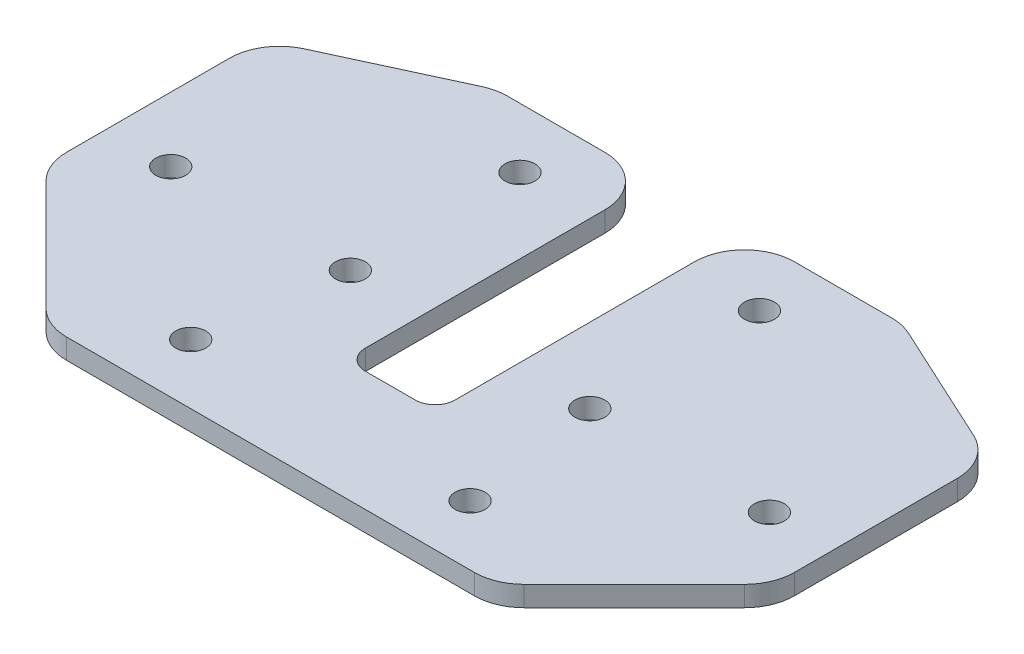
ISO-10303-21;
HEADER;
FILE_DESCRIPTION(('STEP AP214'),'2;1');
FILE_NAME('part.step','',(''),(''),'','','');
FILE_SCHEMA(('AUTOMOTIVE_DESIGN { 1 0 10303 214 1 1 1 1 }'));
ENDSEC;
DATA;
#1=APPLICATION_CONTEXT('core data for automotive mechanical design processes');
#2=APPLICATION_PROTOCOL_DEFINITION('international standard','automotive_design',2000,#1);
#3=PRODUCT_CONTEXT('',#1,'mechanical');
#4=PRODUCT('Part','Part','',(#3));
#5=PRODUCT_RELATED_PRODUCT_CATEGORY('part','',(#4));
#6=PRODUCT_DEFINITION_FORMATION('','',#4);
#7=PRODUCT_DEFINITION_CONTEXT('part definition',#1,'design');
#8=PRODUCT_DEFINITION('design','',#6,#7);
#9=PRODUCT_DEFINITION_SHAPE('','',#8);
#10=(LENGTH_UNIT() NAMED_UNIT(*) SI_UNIT(.MILLI.,.METRE.));
#11=(NAMED_UNIT(*) PLANE_ANGLE_UNIT() SI_UNIT($,.RADIAN.));
#12=(NAMED_UNIT(*) SI_UNIT($,.STERADIAN.) SOLID_ANGLE_UNIT());
#13=UNCERTAINTY_MEASURE_WITH_UNIT(LENGTH_MEASURE(1.E-05),#10,'distance_accuracy_value','');
#14=(GEOMETRIC_REPRESENTATION_CONTEXT(3) GLOBAL_UNCERTAINTY_ASSIGNED_CONTEXT((#13)) GLOBAL_UNIT_ASSIGNED_CONTEXT((#10,
#11,#12)) REPRESENTATION_CONTEXT('',''));
#15=CARTESIAN_POINT('',(0.,0.,0.));
#16=DIRECTION('',(0.,0.,1.));
#17=DIRECTION('',(1.,0.,0.));
#18=AXIS2_PLACEMENT_3D('',#15,#16,#17);
#19=CARTESIAN_POINT('',(0.,2.032,0.));
#20=DIRECTION('',(0.,1.,0.));
#21=DIRECTION('',(0.,0.,1.));
#22=AXIS2_PLACEMENT_3D('',#19,#20,#21);
#23=PLANE('',#22);
#24=CARTESIAN_POINT('',(22.6390243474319,2.032,11.8595094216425));
#25=DIRECTION('',(0.,1.,0.));
#26=DIRECTION('',(0.,0.,1.));
#27=AXIS2_PLACEMENT_3D('',#24,#25,#26);
#28=CIRCLE('',#27,1.5);
#29=CARTESIAN_POINT('',(22.6390243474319,2.032,13.3595094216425));
#30=VERTEX_POINT('',#29);
#31=EDGE_CURVE('E441',#30,#30,#28,.T.);
#32=ORIENTED_EDGE('',*,*,#31,.F.);
#33=EDGE_LOOP('',(#32));
#34=FACE_BOUND('',#33,.T.);
#35=CARTESIAN_POINT('',(24.6390243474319,2.032,-19.1404905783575));
#36=DIRECTION('',(0.,1.,0.));
#37=DIRECTION('',(0.,0.,1.));
#38=AXIS2_PLACEMENT_3D('',#35,#36,#37);
#39=CIRCLE('',#38,1.5);
#40=CARTESIAN_POINT('',(24.6390243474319,2.032,-17.6404905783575));
#41=VERTEX_POINT('',#40);
#42=EDGE_CURVE('E343',#41,#41,#39,.T.);
#43=ORIENTED_EDGE('',*,*,#42,.F.);
#44=EDGE_LOOP('',(#43));
#45=FACE_BOUND('',#44,.T.);
#46=DIRECTION('',(1.,0.,0.));
#47=VECTOR('',#46,1.);
#48=CARTESIAN_POINT('',(41.1390243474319,2.032,-25.1404905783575));
#49=LINE('',#48,#47);
#50=CARTESIAN_POINT('',(46.1390243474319,2.032,-25.1404905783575));
#51=VERTEX_POINT('',#50);
#52=CARTESIAN_POINT('',(55.9142916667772,2.032,-25.1404905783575));
#53=VERTEX_POINT('',#52);
#54=EDGE_CURVE('E420',#51,#53,#49,.T.);
#55=ORIENTED_EDGE('',*,*,#54,.F.);
#56=CARTESIAN_POINT('',(46.1390243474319,2.032,-20.1404905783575));
#57=DIRECTION('',(0.,1.,0.));
#58=DIRECTION('',(0.,0.,1.));
#59=AXIS2_PLACEMENT_3D('',#56,#57,#58);
#60=CIRCLE('',#59,5.);
#61=CARTESIAN_POINT('',(41.1390243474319,2.032,-20.1404905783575));
#62=VERTEX_POINT('',#61);
#63=EDGE_CURVE('E260',#51,#62,#60,.T.);
#64=ORIENTED_EDGE('',*,*,#63,.T.);
#65=DIRECTION('',(0.,0.,-1.));
#66=VECTOR('',#65,1.);
#67=CARTESIAN_POINT('',(41.1390243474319,2.032,5.85950942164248));
#68=LINE('',#67,#66);
#69=CARTESIAN_POINT('',(41.1390243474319,2.032,3.85950942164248));
#70=VERTEX_POINT('',#69);
#71=EDGE_CURVE('E210',#70,#62,#68,.T.);
#72=ORIENTED_EDGE('',*,*,#71,.F.);
#73=CARTESIAN_POINT('',(39.1390243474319,2.032,3.85950942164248));
#74=DIRECTION('',(0.,1.,0.));
#75=DIRECTION('',(0.,0.,1.));
#76=AXIS2_PLACEMENT_3D('',#73,#74,#75);
#77=CIRCLE('',#76,2.);
#78=CARTESIAN_POINT('',(39.1390243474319,2.032,5.85950942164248));
#79=VERTEX_POINT('',#78);
#80=EDGE_CURVE('E11',#70,#79,#77,.F.);
#81=ORIENTED_EDGE('',*,*,#80,.T.);
#82=DIRECTION('',(-1.,0.,0.));
#83=VECTOR('',#82,1.);
#84=CARTESIAN_POINT('',(36.6390243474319,2.032,5.85950942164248));
#85=LINE('',#84,#83);
#86=CARTESIAN_POINT('',(34.1390243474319,2.032,5.85950942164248));
#87=VERTEX_POINT('',#86);
#88=EDGE_CURVE('E325',#79,#87,#85,.T.);
#89=ORIENTED_EDGE('',*,*,#88,.T.);
#90=CARTESIAN_POINT('',(34.1390243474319,2.032,3.85950942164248));
#91=DIRECTION('',(0.,1.,0.));
#92=DIRECTION('',(0.,0.,1.));
#93=AXIS2_PLACEMENT_3D('',#90,#91,#92);
#94=CIRCLE('',#93,2.);
#95=CARTESIAN_POINT('',(32.1390243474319,2.032,3.85950942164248));
#96=VERTEX_POINT('',#95);
#97=EDGE_CURVE('E316',#87,#96,#94,.F.);
#98=ORIENTED_EDGE('',*,*,#97,.T.);
#99=DIRECTION('',(0.,0.,-1.));
#100=VECTOR('',#99,1.);
#101=CARTESIAN_POINT('',(32.1390243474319,2.032,5.85950942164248));
#102=LINE('',#101,#100);
#103=CARTESIAN_POINT('',(32.1390243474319,2.032,-20.1404905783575));
#104=VERTEX_POINT('',#103);
#105=EDGE_CURVE('E323',#96,#104,#102,.T.);
#106=ORIENTED_EDGE('',*,*,#105,.T.);
#107=CARTESIAN_POINT('',(27.1390243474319,2.032,-20.1404905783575));
#108=DIRECTION('',(0.,1.,0.));
#109=DIRECTION('',(0.,0.,1.));
#110=AXIS2_PLACEMENT_3D('',#107,#108,#109);
#111=CIRCLE('',#110,5.);
#112=CARTESIAN_POINT('',(27.1390243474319,2.032,-25.1404905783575));
#113=VERTEX_POINT('',#112);
#114=EDGE_CURVE('E242',#104,#113,#111,.T.);
#115=ORIENTED_EDGE('',*,*,#114,.T.);
#116=DIRECTION('',(-1.,0.,0.));
#117=VECTOR('',#116,1.);
#118=CARTESIAN_POINT('',(32.1390243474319,2.032,-25.1404905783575));
#119=LINE('',#118,#117);
#120=CARTESIAN_POINT('',(17.3637570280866,2.032,-25.1404905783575));
#121=VERTEX_POINT('',#120);
#122=EDGE_CURVE('E334',#113,#121,#119,.T.);
#123=ORIENTED_EDGE('',*,*,#122,.T.);
#124=CARTESIAN_POINT('',(17.3637570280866,2.032,-20.1404905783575));
#125=DIRECTION('',(0.,1.,0.));
#126=DIRECTION('',(0.,0.,1.));
#127=AXIS2_PLACEMENT_3D('',#124,#125,#126);
#128=CIRCLE('',#127,5.);
#129=CARTESIAN_POINT('',(15.2657842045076,2.032,-24.6790487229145));
#130=VERTEX_POINT('',#129);
#131=EDGE_CURVE('E244',#121,#130,#128,.T.);
#132=ORIENTED_EDGE('',*,*,#131,.T.);
#133=DIRECTION('',(-0.907711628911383,0.,0.419594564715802));
#134=VECTOR('',#133,1.);
#135=CARTESIAN_POINT('',(16.2640243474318,2.032,-25.1404905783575));
#136=LINE('',#135,#134);
#137=CARTESIAN_POINT('',(3.07105152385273,2.032,-19.0419681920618));
#138=VERTEX_POINT('',#137);
#139=EDGE_CURVE('E378',#130,#138,#136,.T.);
#140=ORIENTED_EDGE('',*,*,#139,.T.);
#141=CARTESIAN_POINT('',(5.16902434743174,2.032,-14.5034100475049));
#142=DIRECTION('',(0.,1.,0.));
#143=DIRECTION('',(0.,0.,1.));
#144=AXIS2_PLACEMENT_3D('',#141,#142,#143);
#145=CIRCLE('',#144,5.);
#146=CARTESIAN_POINT('',(0.169024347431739,2.032,-14.5034100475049));
#147=VERTEX_POINT('',#146);
#148=EDGE_CURVE('E246',#138,#147,#145,.T.);
#149=ORIENTED_EDGE('',*,*,#148,.T.);
#150=DIRECTION('',(0.,0.,1.));
#151=VECTOR('',#150,1.);
#152=CARTESIAN_POINT('',(0.169024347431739,2.032,-10.0804905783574));
#153=LINE('',#152,#151);
#154=CARTESIAN_POINT('',(0.169024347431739,2.032,1.81844160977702));
#155=VERTEX_POINT('',#154);
#156=EDGE_CURVE('E219',#147,#155,#153,.T.);
#157=ORIENTED_EDGE('',*,*,#156,.T.);
#158=CARTESIAN_POINT('',(5.16902434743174,2.032,1.81844160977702));
#159=DIRECTION('',(0.,1.,0.));
#160=DIRECTION('',(0.,0.,1.));
#161=AXIS2_PLACEMENT_3D('',#158,#159,#160);
#162=CIRCLE('',#161,5.);
#163=CARTESIAN_POINT('',(1.633490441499,2.032,5.35397551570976));
#164=VERTEX_POINT('',#163);
#165=EDGE_CURVE('E248',#155,#164,#162,.T.);
#166=ORIENTED_EDGE('',*,*,#165,.T.);
#167=DIRECTION('',(0.707106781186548,0.,0.707106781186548));
#168=VECTOR('',#167,1.);
#169=CARTESIAN_POINT('',(14.1390243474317,2.032,17.8595094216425));
#170=LINE('',#169,#168);
#171=CARTESIAN_POINT('',(12.6745582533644,2.032,16.3950433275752));
#172=VERTEX_POINT('',#171);
#173=EDGE_CURVE('E213',#164,#172,#170,.T.);
#174=ORIENTED_EDGE('',*,*,#173,.T.);
#175=CARTESIAN_POINT('',(16.2100921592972,2.032,12.8595094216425));
#176=DIRECTION('',(0.,1.,0.));
#177=DIRECTION('',(0.,0.,1.));
#178=AXIS2_PLACEMENT_3D('',#175,#176,#177);
#179=CIRCLE('',#178,5.);
#180=CARTESIAN_POINT('',(16.2100921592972,2.032,17.8595094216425));
#181=VERTEX_POINT('',#180);
#182=EDGE_CURVE('E250',#172,#181,#179,.T.);
#183=ORIENTED_EDGE('',*,*,#182,.T.);
#184=DIRECTION('',(1.,0.,0.));
#185=VECTOR('',#184,1.);
#186=CARTESIAN_POINT('',(32.1390243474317,2.032,17.8595094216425));
#187=LINE('',#186,#185);
#188=CARTESIAN_POINT('',(57.0679565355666,2.032,17.8595094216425));
#189=VERTEX_POINT('',#188);
#190=EDGE_CURVE('E365',#181,#189,#187,.T.);
#191=ORIENTED_EDGE('',*,*,#190,.T.);
#192=CARTESIAN_POINT('',(57.0679565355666,2.032,12.8595094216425));
#193=DIRECTION('',(0.,1.,0.));
#194=DIRECTION('',(0.,0.,1.));
#195=AXIS2_PLACEMENT_3D('',#192,#193,#194);
#196=CIRCLE('',#195,5.);
#197=CARTESIAN_POINT('',(60.6034904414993,2.032,16.3950433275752));
#198=VERTEX_POINT('',#197);
#199=EDGE_CURVE('E252',#189,#198,#196,.T.);
#200=ORIENTED_EDGE('',*,*,#199,.T.);
#201=DIRECTION('',(-0.707106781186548,0.,0.707106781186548));
#202=VECTOR('',#201,1.);
#203=CARTESIAN_POINT('',(59.1390243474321,2.032,17.8595094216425));
#204=LINE('',#203,#202);
#205=CARTESIAN_POINT('',(71.6445582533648,2.032,5.35397551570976));
#206=VERTEX_POINT('',#205);
#207=EDGE_CURVE('E196',#206,#198,#204,.T.);
#208=ORIENTED_EDGE('',*,*,#207,.F.);
#209=CARTESIAN_POINT('',(68.109024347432,2.032,1.81844160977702));
#210=DIRECTION('',(0.,1.,0.));
#211=DIRECTION('',(0.,0.,1.));
#212=AXIS2_PLACEMENT_3D('',#209,#210,#211);
#213=CIRCLE('',#212,5.);
#214=CARTESIAN_POINT('',(73.109024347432,2.032,1.81844160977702));
#215=VERTEX_POINT('',#214);
#216=EDGE_CURVE('E254',#206,#215,#213,.T.);
#217=ORIENTED_EDGE('',*,*,#216,.T.);
#218=DIRECTION('',(0.,0.,1.));
#219=VECTOR('',#218,1.);
#220=CARTESIAN_POINT('',(73.109024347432,2.032,-10.0804905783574));
#221=LINE('',#220,#219);
#222=CARTESIAN_POINT('',(73.109024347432,2.032,-14.5034100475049));
#223=VERTEX_POINT('',#222);
#224=EDGE_CURVE('E409',#223,#215,#221,.T.);
#225=ORIENTED_EDGE('',*,*,#224,.F.);
#226=CARTESIAN_POINT('',(68.109024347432,2.032,-14.5034100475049));
#227=DIRECTION('',(0.,1.,0.));
#228=DIRECTION('',(0.,0.,1.));
#229=AXIS2_PLACEMENT_3D('',#226,#227,#228);
#230=CIRCLE('',#229,5.);
#231=CARTESIAN_POINT('',(70.206997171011,2.032,-19.0419681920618));
#232=VERTEX_POINT('',#231);
#233=EDGE_CURVE('E256',#223,#232,#230,.T.);
#234=ORIENTED_EDGE('',*,*,#233,.T.);
#235=DIRECTION('',(0.907711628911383,0.,0.419594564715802));
#236=VECTOR('',#235,1.);
#237=CARTESIAN_POINT('',(57.014024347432,2.032,-25.1404905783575));
#238=LINE('',#237,#236);
#239=CARTESIAN_POINT('',(58.0122644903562,2.032,-24.6790487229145));
#240=VERTEX_POINT('',#239);
#241=EDGE_CURVE('E412',#240,#232,#238,.T.);
#242=ORIENTED_EDGE('',*,*,#241,.F.);
#243=CARTESIAN_POINT('',(55.9142916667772,2.032,-20.1404905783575));
#244=DIRECTION('',(0.,1.,0.));
#245=DIRECTION('',(0.,0.,1.));
#246=AXIS2_PLACEMENT_3D('',#243,#244,#245);
#247=CIRCLE('',#246,5.);
#248=EDGE_CURVE('E258',#240,#53,#247,.T.);
#249=ORIENTED_EDGE('',*,*,#248,.T.);
#250=EDGE_LOOP('',(#55,#64,#72,#81,#89,#98,#106,#115,#123,#132,#140,#149,#157,#166,#174,#183,
#191,#200,#208,#217,#225,#234,#242,#249));
#251=FACE_BOUND('',#250,.T.);
#252=CARTESIAN_POINT('',(24.6390243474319,2.032,-2.14049057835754));
#253=DIRECTION('',(0.,1.,0.));
#254=DIRECTION('',(0.,0.,1.));
#255=AXIS2_PLACEMENT_3D('',#252,#253,#254);
#256=CIRCLE('',#255,1.5);
#257=CARTESIAN_POINT('',(24.6390243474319,2.032,-0.640490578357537));
#258=VERTEX_POINT('',#257);
#259=EDGE_CURVE('E447',#258,#258,#256,.T.);
#260=ORIENTED_EDGE('',*,*,#259,.F.);
#261=EDGE_LOOP('',(#260));
#262=FACE_BOUND('',#261,.T.);
#263=CARTESIAN_POINT('',(6.63902434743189,2.032,-2.14049057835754));
#264=DIRECTION('',(0.,1.,0.));
#265=DIRECTION('',(0.,0.,1.));
#266=AXIS2_PLACEMENT_3D('',#263,#264,#265);
#267=CIRCLE('',#266,1.5);
#268=CARTESIAN_POINT('',(6.63902434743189,2.032,-0.640490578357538));
#269=VERTEX_POINT('',#268);
#270=EDGE_CURVE('E435',#269,#269,#267,.T.);
#271=ORIENTED_EDGE('',*,*,#270,.F.);
#272=EDGE_LOOP('',(#271));
#273=FACE_BOUND('',#272,.T.);
#274=CARTESIAN_POINT('',(66.6390243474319,2.032,-2.14049057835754));
#275=DIRECTION('',(0.,-1.,0.));
#276=DIRECTION('',(0.,0.,1.));
#277=AXIS2_PLACEMENT_3D('',#274,#275,#276);
#278=CIRCLE('',#277,1.5);
#279=CARTESIAN_POINT('',(66.6390243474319,2.032,-0.640490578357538));
#280=VERTEX_POINT('',#279);
#281=EDGE_CURVE('E599',#280,#280,#278,.T.);
#282=ORIENTED_EDGE('',*,*,#281,.T.);
#283=EDGE_LOOP('',(#282));
#284=FACE_BOUND('',#283,.T.);
#285=CARTESIAN_POINT('',(50.6390243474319,2.032,11.8595094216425));
#286=DIRECTION('',(0.,-1.,0.));
#287=DIRECTION('',(0.,0.,1.));
#288=AXIS2_PLACEMENT_3D('',#285,#286,#287);
#289=CIRCLE('',#288,1.5);
#290=CARTESIAN_POINT('',(50.6390243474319,2.032,13.3595094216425));
#291=VERTEX_POINT('',#290);
#292=EDGE_CURVE('E595',#291,#291,#289,.T.);
#293=ORIENTED_EDGE('',*,*,#292,.T.);
#294=EDGE_LOOP('',(#293));
#295=FACE_BOUND('',#294,.T.);
#296=CARTESIAN_POINT('',(48.6390243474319,2.032,-2.14049057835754));
#297=DIRECTION('',(0.,-1.,0.));
#298=DIRECTION('',(0.,0.,1.));
#299=AXIS2_PLACEMENT_3D('',#296,#297,#298);
#300=CIRCLE('',#299,1.5);
#301=CARTESIAN_POINT('',(48.6390243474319,2.032,-0.640490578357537));
#302=VERTEX_POINT('',#301);
#303=EDGE_CURVE('E589',#302,#302,#300,.T.);
#304=ORIENTED_EDGE('',*,*,#303,.T.);
#305=EDGE_LOOP('',(#304));
#306=FACE_BOUND('',#305,.T.);
#307=CARTESIAN_POINT('',(48.6390243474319,2.032,-19.1404905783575));
#308=DIRECTION('',(0.,-1.,0.));
#309=DIRECTION('',(0.,0.,1.));
#310=AXIS2_PLACEMENT_3D('',#307,#308,#309);
#311=CIRCLE('',#310,1.5);
#312=CARTESIAN_POINT('',(48.6390243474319,2.032,-17.6404905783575));
#313=VERTEX_POINT('',#312);
#314=EDGE_CURVE('E428',#313,#313,#311,.T.);
#315=ORIENTED_EDGE('',*,*,#314,.T.);
#316=EDGE_LOOP('',(#315));
#317=FACE_BOUND('',#316,.T.);
#318=ADVANCED_FACE('F32',(#34,#45,#251,#262,#273,#284,#295,#306,#317),#23,.T.);
#319=CARTESIAN_POINT('',(0.,0.,0.));
#320=DIRECTION('',(0.,1.,0.));
#321=DIRECTION('',(0.,0.,1.));
#322=AXIS2_PLACEMENT_3D('',#319,#320,#321);
#323=PLANE('',#322);
#324=CARTESIAN_POINT('',(22.6390243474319,0.,11.8595094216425));
#325=DIRECTION('',(0.,1.,0.));
#326=DIRECTION('',(0.,0.,1.));
#327=AXIS2_PLACEMENT_3D('',#324,#325,#326);
#328=CIRCLE('',#327,1.5);
#329=CARTESIAN_POINT('',(22.6390243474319,0.,13.3595094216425));
#330=VERTEX_POINT('',#329);
#331=EDGE_CURVE('E438',#330,#330,#328,.T.);
#332=ORIENTED_EDGE('',*,*,#331,.T.);
#333=EDGE_LOOP('',(#332));
#334=FACE_BOUND('',#333,.T.);
#335=CARTESIAN_POINT('',(24.6390243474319,0.,-19.1404905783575));
#336=DIRECTION('',(0.,1.,0.));
#337=DIRECTION('',(0.,0.,1.));
#338=AXIS2_PLACEMENT_3D('',#335,#336,#337);
#339=CIRCLE('',#338,1.5);
#340=CARTESIAN_POINT('',(24.6390243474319,0.,-17.6404905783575));
#341=VERTEX_POINT('',#340);
#342=EDGE_CURVE('E348',#341,#341,#339,.T.);
#343=ORIENTED_EDGE('',*,*,#342,.T.);
#344=EDGE_LOOP('',(#343));
#345=FACE_BOUND('',#344,.T.);
#346=DIRECTION('',(-1.,0.,0.));
#347=VECTOR('',#346,1.);
#348=CARTESIAN_POINT('',(36.6390243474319,0.,5.85950942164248));
#349=LINE('',#348,#347);
#350=CARTESIAN_POINT('',(39.1390243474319,0.,5.85950942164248));
#351=VERTEX_POINT('',#350);
#352=CARTESIAN_POINT('',(34.1390243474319,0.,5.85950942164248));
#353=VERTEX_POINT('',#352);
#354=EDGE_CURVE('E338',#351,#353,#349,.T.);
#355=ORIENTED_EDGE('',*,*,#354,.F.);
#356=CARTESIAN_POINT('',(39.1390243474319,0.,3.85950942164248));
#357=DIRECTION('',(0.,1.,0.));
#358=DIRECTION('',(0.,0.,1.));
#359=AXIS2_PLACEMENT_3D('',#356,#357,#358);
#360=CIRCLE('',#359,2.);
#361=CARTESIAN_POINT('',(41.1390243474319,0.,3.85950942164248));
#362=VERTEX_POINT('',#361);
#363=EDGE_CURVE('E40',#351,#362,#360,.T.);
#364=ORIENTED_EDGE('',*,*,#363,.T.);
#365=DIRECTION('',(0.,0.,-1.));
#366=VECTOR('',#365,1.);
#367=CARTESIAN_POINT('',(41.1390243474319,0.,5.85950942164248));
#368=LINE('',#367,#366);
#369=CARTESIAN_POINT('',(41.1390243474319,0.,-20.1404905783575));
#370=VERTEX_POINT('',#369);
#371=EDGE_CURVE('E188',#362,#370,#368,.T.);
#372=ORIENTED_EDGE('',*,*,#371,.T.);
#373=CARTESIAN_POINT('',(46.1390243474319,0.,-20.1404905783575));
#374=DIRECTION('',(0.,1.,0.));
#375=DIRECTION('',(0.,0.,1.));
#376=AXIS2_PLACEMENT_3D('',#373,#374,#375);
#377=CIRCLE('',#376,5.);
#378=CARTESIAN_POINT('',(46.1390243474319,0.,-25.1404905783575));
#379=VERTEX_POINT('',#378);
#380=EDGE_CURVE('E193',#370,#379,#377,.F.);
#381=ORIENTED_EDGE('',*,*,#380,.T.);
#382=DIRECTION('',(1.,0.,0.));
#383=VECTOR('',#382,1.);
#384=CARTESIAN_POINT('',(41.1390243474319,0.,-25.1404905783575));
#385=LINE('',#384,#383);
#386=CARTESIAN_POINT('',(55.9142916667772,0.,-25.1404905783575));
#387=VERTEX_POINT('',#386);
#388=EDGE_CURVE('E197',#379,#387,#385,.T.);
#389=ORIENTED_EDGE('',*,*,#388,.T.);
#390=CARTESIAN_POINT('',(55.9142916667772,0.,-20.1404905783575));
#391=DIRECTION('',(0.,1.,0.));
#392=DIRECTION('',(0.,0.,1.));
#393=AXIS2_PLACEMENT_3D('',#390,#391,#392);
#394=CIRCLE('',#393,5.);
#395=CARTESIAN_POINT('',(58.0122644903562,0.,-24.6790487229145));
#396=VERTEX_POINT('',#395);
#397=EDGE_CURVE('E207',#387,#396,#394,.F.);
#398=ORIENTED_EDGE('',*,*,#397,.T.);
#399=DIRECTION('',(0.907711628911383,0.,0.419594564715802));
#400=VECTOR('',#399,1.);
#401=CARTESIAN_POINT('',(57.014024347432,0.,-25.1404905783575));
#402=LINE('',#401,#400);
#403=CARTESIAN_POINT('',(70.206997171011,0.,-19.0419681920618));
#404=VERTEX_POINT('',#403);
#405=EDGE_CURVE('E431',#396,#404,#402,.T.);
#406=ORIENTED_EDGE('',*,*,#405,.T.);
#407=CARTESIAN_POINT('',(68.109024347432,0.,-14.5034100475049));
#408=DIRECTION('',(0.,1.,0.));
#409=DIRECTION('',(0.,0.,1.));
#410=AXIS2_PLACEMENT_3D('',#407,#408,#409);
#411=CIRCLE('',#410,5.);
#412=CARTESIAN_POINT('',(73.109024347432,0.,-14.5034100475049));
#413=VERTEX_POINT('',#412);
#414=EDGE_CURVE('E236',#404,#413,#411,.F.);
#415=ORIENTED_EDGE('',*,*,#414,.T.);
#416=DIRECTION('',(0.,0.,1.));
#417=VECTOR('',#416,1.);
#418=CARTESIAN_POINT('',(73.109024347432,0.,-10.0804905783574));
#419=LINE('',#418,#417);
#420=CARTESIAN_POINT('',(73.109024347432,0.,1.81844160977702));
#421=VERTEX_POINT('',#420);
#422=EDGE_CURVE('E427',#413,#421,#419,.T.);
#423=ORIENTED_EDGE('',*,*,#422,.T.);
#424=CARTESIAN_POINT('',(68.109024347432,0.,1.81844160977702));
#425=DIRECTION('',(0.,1.,0.));
#426=DIRECTION('',(0.,0.,1.));
#427=AXIS2_PLACEMENT_3D('',#424,#425,#426);
#428=CIRCLE('',#427,5.);
#429=CARTESIAN_POINT('',(71.6445582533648,0.,5.35397551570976));
#430=VERTEX_POINT('',#429);
#431=EDGE_CURVE('E234',#421,#430,#428,.F.);
#432=ORIENTED_EDGE('',*,*,#431,.T.);
#433=DIRECTION('',(-0.707106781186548,0.,0.707106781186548));
#434=VECTOR('',#433,1.);
#435=CARTESIAN_POINT('',(59.1390243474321,0.,17.8595094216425));
#436=LINE('',#435,#434);
#437=CARTESIAN_POINT('',(60.6034904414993,0.,16.3950433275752));
#438=VERTEX_POINT('',#437);
#439=EDGE_CURVE('E425',#430,#438,#436,.T.);
#440=ORIENTED_EDGE('',*,*,#439,.T.);
#441=CARTESIAN_POINT('',(57.0679565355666,0.,12.8595094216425));
#442=DIRECTION('',(0.,1.,0.));
#443=DIRECTION('',(0.,0.,1.));
#444=AXIS2_PLACEMENT_3D('',#441,#442,#443);
#445=CIRCLE('',#444,5.);
#446=CARTESIAN_POINT('',(57.0679565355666,0.,17.8595094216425));
#447=VERTEX_POINT('',#446);
#448=EDGE_CURVE('E232',#438,#447,#445,.F.);
#449=ORIENTED_EDGE('',*,*,#448,.T.);
#450=DIRECTION('',(1.,0.,0.));
#451=VECTOR('',#450,1.);
#452=CARTESIAN_POINT('',(32.1390243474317,0.,17.8595094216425));
#453=LINE('',#452,#451);
#454=CARTESIAN_POINT('',(16.2100921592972,0.,17.8595094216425));
#455=VERTEX_POINT('',#454);
#456=EDGE_CURVE('E222',#455,#447,#453,.T.);
#457=ORIENTED_EDGE('',*,*,#456,.F.);
#458=CARTESIAN_POINT('',(16.2100921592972,0.,12.8595094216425));
#459=DIRECTION('',(0.,1.,0.));
#460=DIRECTION('',(0.,0.,1.));
#461=AXIS2_PLACEMENT_3D('',#458,#459,#460);
#462=CIRCLE('',#461,5.);
#463=CARTESIAN_POINT('',(12.6745582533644,0.,16.3950433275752));
#464=VERTEX_POINT('',#463);
#465=EDGE_CURVE('E230',#455,#464,#462,.F.);
#466=ORIENTED_EDGE('',*,*,#465,.T.);
#467=DIRECTION('',(0.707106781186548,0.,0.707106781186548));
#468=VECTOR('',#467,1.);
#469=CARTESIAN_POINT('',(14.1390243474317,0.,17.8595094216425));
#470=LINE('',#469,#468);
#471=CARTESIAN_POINT('',(1.633490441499,0.,5.35397551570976));
#472=VERTEX_POINT('',#471);
#473=EDGE_CURVE('E359',#472,#464,#470,.T.);
#474=ORIENTED_EDGE('',*,*,#473,.F.);
#475=CARTESIAN_POINT('',(5.16902434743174,0.,1.81844160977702));
#476=DIRECTION('',(0.,1.,0.));
#477=DIRECTION('',(0.,0.,1.));
#478=AXIS2_PLACEMENT_3D('',#475,#476,#477);
#479=CIRCLE('',#478,5.);
#480=CARTESIAN_POINT('',(0.169024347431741,0.,1.81844160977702));
#481=VERTEX_POINT('',#480);
#482=EDGE_CURVE('E228',#472,#481,#479,.F.);
#483=ORIENTED_EDGE('',*,*,#482,.T.);
#484=DIRECTION('',(0.,0.,1.));
#485=VECTOR('',#484,1.);
#486=CARTESIAN_POINT('',(0.169024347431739,0.,-10.0804905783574));
#487=LINE('',#486,#485);
#488=CARTESIAN_POINT('',(0.169024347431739,0.,-14.5034100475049));
#489=VERTEX_POINT('',#488);
#490=EDGE_CURVE('E357',#489,#481,#487,.T.);
#491=ORIENTED_EDGE('',*,*,#490,.F.);
#492=CARTESIAN_POINT('',(5.16902434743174,0.,-14.5034100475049));
#493=DIRECTION('',(0.,1.,0.));
#494=DIRECTION('',(0.,0.,1.));
#495=AXIS2_PLACEMENT_3D('',#492,#493,#494);
#496=CIRCLE('',#495,5.);
#497=CARTESIAN_POINT('',(3.07105152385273,0.,-19.0419681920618));
#498=VERTEX_POINT('',#497);
#499=EDGE_CURVE('E226',#489,#498,#496,.F.);
#500=ORIENTED_EDGE('',*,*,#499,.T.);
#501=DIRECTION('',(-0.907711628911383,0.,0.419594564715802));
#502=VECTOR('',#501,1.);
#503=CARTESIAN_POINT('',(16.2640243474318,0.,-25.1404905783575));
#504=LINE('',#503,#502);
#505=CARTESIAN_POINT('',(15.2657842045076,0.,-24.6790487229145));
#506=VERTEX_POINT('',#505);
#507=EDGE_CURVE('E354',#506,#498,#504,.T.);
#508=ORIENTED_EDGE('',*,*,#507,.F.);
#509=CARTESIAN_POINT('',(17.3637570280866,0.,-20.1404905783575));
#510=DIRECTION('',(0.,1.,0.));
#511=DIRECTION('',(0.,0.,1.));
#512=AXIS2_PLACEMENT_3D('',#509,#510,#511);
#513=CIRCLE('',#512,5.);
#514=CARTESIAN_POINT('',(17.3637570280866,0.,-25.1404905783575));
#515=VERTEX_POINT('',#514);
#516=EDGE_CURVE('E216',#506,#515,#513,.F.);
#517=ORIENTED_EDGE('',*,*,#516,.T.);
#518=DIRECTION('',(-1.,0.,0.));
#519=VECTOR('',#518,1.);
#520=CARTESIAN_POINT('',(32.1390243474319,0.,-25.1404905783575));
#521=LINE('',#520,#519);
#522=CARTESIAN_POINT('',(27.1390243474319,0.,-25.1404905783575));
#523=VERTEX_POINT('',#522);
#524=EDGE_CURVE('E345',#523,#515,#521,.T.);
#525=ORIENTED_EDGE('',*,*,#524,.F.);
#526=CARTESIAN_POINT('',(27.1390243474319,0.,-20.1404905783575));
#527=DIRECTION('',(0.,1.,0.));
#528=DIRECTION('',(0.,0.,1.));
#529=AXIS2_PLACEMENT_3D('',#526,#527,#528);
#530=CIRCLE('',#529,5.);
#531=CARTESIAN_POINT('',(32.1390243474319,0.,-20.1404905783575));
#532=VERTEX_POINT('',#531);
#533=EDGE_CURVE('E212',#523,#532,#530,.F.);
#534=ORIENTED_EDGE('',*,*,#533,.T.);
#535=DIRECTION('',(0.,0.,-1.));
#536=VECTOR('',#535,1.);
#537=CARTESIAN_POINT('',(32.1390243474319,0.,5.85950942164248));
#538=LINE('',#537,#536);
#539=CARTESIAN_POINT('',(32.1390243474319,0.,3.85950942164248));
#540=VERTEX_POINT('',#539);
#541=EDGE_CURVE('E339',#540,#532,#538,.T.);
#542=ORIENTED_EDGE('',*,*,#541,.F.);
#543=CARTESIAN_POINT('',(34.1390243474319,0.,3.85950942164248));
#544=DIRECTION('',(0.,1.,0.));
#545=DIRECTION('',(0.,0.,1.));
#546=AXIS2_PLACEMENT_3D('',#543,#544,#545);
#547=CIRCLE('',#546,2.);
#548=EDGE_CURVE('E314',#540,#353,#547,.T.);
#549=ORIENTED_EDGE('',*,*,#548,.T.);
#550=EDGE_LOOP('',(#355,#364,#372,#381,#389,#398,#406,#415,#423,#432,#440,#449,#457,#466,#474,
#483,#491,#500,#508,#517,#525,#534,#542,#549));
#551=FACE_BOUND('',#550,.T.);
#552=CARTESIAN_POINT('',(24.6390243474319,0.,-2.14049057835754));
#553=DIRECTION('',(0.,1.,0.));
#554=DIRECTION('',(0.,0.,1.));
#555=AXIS2_PLACEMENT_3D('',#552,#553,#554);
#556=CIRCLE('',#555,1.5);
#557=CARTESIAN_POINT('',(24.6390243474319,0.,-0.640490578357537));
#558=VERTEX_POINT('',#557);
#559=EDGE_CURVE('E444',#558,#558,#556,.T.);
#560=ORIENTED_EDGE('',*,*,#559,.T.);
#561=EDGE_LOOP('',(#560));
#562=FACE_BOUND('',#561,.T.);
#563=CARTESIAN_POINT('',(6.63902434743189,0.,-2.14049057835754));
#564=DIRECTION('',(0.,1.,0.));
#565=DIRECTION('',(0.,0.,1.));
#566=AXIS2_PLACEMENT_3D('',#563,#564,#565);
#567=CIRCLE('',#566,1.5);
#568=CARTESIAN_POINT('',(6.63902434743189,0.,-0.640490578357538));
#569=VERTEX_POINT('',#568);
#570=EDGE_CURVE('E424',#569,#569,#567,.T.);
#571=ORIENTED_EDGE('',*,*,#570,.T.);
#572=EDGE_LOOP('',(#571));
#573=FACE_BOUND('',#572,.T.);
#574=CARTESIAN_POINT('',(66.6390243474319,0.,-2.14049057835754));
#575=DIRECTION('',(0.,-1.,0.));
#576=DIRECTION('',(0.,0.,1.));
#577=AXIS2_PLACEMENT_3D('',#574,#575,#576);
#578=CIRCLE('',#577,1.5);
#579=CARTESIAN_POINT('',(66.6390243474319,0.,-0.640490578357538));
#580=VERTEX_POINT('',#579);
#581=EDGE_CURVE('E577',#580,#580,#578,.T.);
#582=ORIENTED_EDGE('',*,*,#581,.F.);
#583=EDGE_LOOP('',(#582));
#584=FACE_BOUND('',#583,.T.);
#585=CARTESIAN_POINT('',(50.6390243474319,0.,11.8595094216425));
#586=DIRECTION('',(0.,-1.,0.));
#587=DIRECTION('',(0.,0.,1.));
#588=AXIS2_PLACEMENT_3D('',#585,#586,#587);
#589=CIRCLE('',#588,1.5);
#590=CARTESIAN_POINT('',(50.6390243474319,0.,13.3595094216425));
#591=VERTEX_POINT('',#590);
#592=EDGE_CURVE('E581',#591,#591,#589,.T.);
#593=ORIENTED_EDGE('',*,*,#592,.F.);
#594=EDGE_LOOP('',(#593));
#595=FACE_BOUND('',#594,.T.);
#596=CARTESIAN_POINT('',(48.6390243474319,0.,-2.14049057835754));
#597=DIRECTION('',(0.,-1.,0.));
#598=DIRECTION('',(0.,0.,1.));
#599=AXIS2_PLACEMENT_3D('',#596,#597,#598);
#600=CIRCLE('',#599,1.5);
#601=CARTESIAN_POINT('',(48.6390243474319,0.,-0.640490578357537));
#602=VERTEX_POINT('',#601);
#603=EDGE_CURVE('E585',#602,#602,#600,.T.);
#604=ORIENTED_EDGE('',*,*,#603,.F.);
#605=EDGE_LOOP('',(#604));
#606=FACE_BOUND('',#605,.T.);
#607=CARTESIAN_POINT('',(48.6390243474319,0.,-19.1404905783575));
#608=DIRECTION('',(0.,-1.,0.));
#609=DIRECTION('',(0.,0.,1.));
#610=AXIS2_PLACEMENT_3D('',#607,#608,#609);
#611=CIRCLE('',#610,1.5);
#612=CARTESIAN_POINT('',(48.6390243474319,0.,-17.6404905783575));
#613=VERTEX_POINT('',#612);
#614=EDGE_CURVE('E415',#613,#613,#611,.T.);
#615=ORIENTED_EDGE('',*,*,#614,.F.);
#616=EDGE_LOOP('',(#615));
#617=FACE_BOUND('',#616,.T.);
#618=ADVANCED_FACE('F190',(#334,#345,#551,#562,#573,#584,#595,#606,#617),#323,.F.);
#619=CARTESIAN_POINT('',(36.6390243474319,2.032,5.85950942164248));
#620=DIRECTION('',(0.,0.,1.));
#621=DIRECTION('',(1.,0.,0.));
#622=AXIS2_PLACEMENT_3D('',#619,#620,#621);
#623=PLANE('',#622);
#624=ORIENTED_EDGE('',*,*,#354,.T.);
#625=DIRECTION('',(0.,-1.,0.));
#626=VECTOR('',#625,1.);
#627=CARTESIAN_POINT('',(34.1390243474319,2.032,5.85950942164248));
#628=LINE('',#627,#626);
#629=EDGE_CURVE('E311',#353,#87,#628,.F.);
#630=ORIENTED_EDGE('',*,*,#629,.T.);
#631=ORIENTED_EDGE('',*,*,#88,.F.);
#632=DIRECTION('',(0.,-1.,0.));
#633=VECTOR('',#632,1.);
#634=CARTESIAN_POINT('',(39.1390243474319,2.032,5.85950942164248));
#635=LINE('',#634,#633);
#636=EDGE_CURVE('E308',#79,#351,#635,.T.);
#637=ORIENTED_EDGE('',*,*,#636,.T.);
#638=EDGE_LOOP('',(#624,#630,#631,#637));
#639=FACE_BOUND('',#638,.T.);
#640=ADVANCED_FACE('F341',(#639),#623,.F.);
#641=CARTESIAN_POINT('',(32.1390243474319,2.032,5.85950942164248));
#642=DIRECTION('',(-1.,0.,0.));
#643=DIRECTION('',(0.,0.,1.));
#644=AXIS2_PLACEMENT_3D('',#641,#642,#643);
#645=PLANE('',#644);
#646=ORIENTED_EDGE('',*,*,#105,.F.);
#647=DIRECTION('',(0.,-1.,0.));
#648=VECTOR('',#647,1.);
#649=CARTESIAN_POINT('',(32.1390243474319,0.,3.85950942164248));
#650=LINE('',#649,#648);
#651=EDGE_CURVE('E305',#96,#540,#650,.T.);
#652=ORIENTED_EDGE('',*,*,#651,.T.);
#653=ORIENTED_EDGE('',*,*,#541,.T.);
#654=DIRECTION('',(0.,-1.,0.));
#655=VECTOR('',#654,1.);
#656=CARTESIAN_POINT('',(32.1390243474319,2.032,-20.1404905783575));
#657=LINE('',#656,#655);
#658=EDGE_CURVE('E302',#532,#104,#657,.F.);
#659=ORIENTED_EDGE('',*,*,#658,.T.);
#660=EDGE_LOOP('',(#646,#652,#653,#659));
#661=FACE_BOUND('',#660,.T.);
#662=ADVANCED_FACE('F330',(#661),#645,.F.);
#663=CARTESIAN_POINT('',(32.1390243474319,2.032,-25.1404905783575));
#664=DIRECTION('',(0.,0.,1.));
#665=DIRECTION('',(1.,0.,0.));
#666=AXIS2_PLACEMENT_3D('',#663,#664,#665);
#667=PLANE('',#666);
#668=ORIENTED_EDGE('',*,*,#524,.T.);
#669=DIRECTION('',(0.,-1.,0.));
#670=VECTOR('',#669,1.);
#671=CARTESIAN_POINT('',(17.3637570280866,2.032,-25.1404905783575));
#672=LINE('',#671,#670);
#673=EDGE_CURVE('E300',#515,#121,#672,.F.);
#674=ORIENTED_EDGE('',*,*,#673,.T.);
#675=ORIENTED_EDGE('',*,*,#122,.F.);
#676=DIRECTION('',(0.,-1.,0.));
#677=VECTOR('',#676,1.);
#678=CARTESIAN_POINT('',(27.1390243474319,2.032,-25.1404905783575));
#679=LINE('',#678,#677);
#680=EDGE_CURVE('E297',#113,#523,#679,.T.);
#681=ORIENTED_EDGE('',*,*,#680,.T.);
#682=EDGE_LOOP('',(#668,#674,#675,#681));
#683=FACE_BOUND('',#682,.T.);
#684=ADVANCED_FACE('F490',(#683),#667,.F.);
#685=CARTESIAN_POINT('',(16.2640243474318,2.032,-25.1404905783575));
#686=DIRECTION('',(0.419594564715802,0.,0.907711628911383));
#687=DIRECTION('',(0.907711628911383,0.,-0.419594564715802));
#688=AXIS2_PLACEMENT_3D('',#685,#686,#687);
#689=PLANE('',#688);
#690=ORIENTED_EDGE('',*,*,#507,.T.);
#691=DIRECTION('',(0.,-1.,0.));
#692=VECTOR('',#691,1.);
#693=CARTESIAN_POINT('',(3.07105152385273,2.032,-19.0419681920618));
#694=LINE('',#693,#692);
#695=EDGE_CURVE('E295',#498,#138,#694,.F.);
#696=ORIENTED_EDGE('',*,*,#695,.T.);
#697=ORIENTED_EDGE('',*,*,#139,.F.);
#698=DIRECTION('',(0.,-1.,0.));
#699=VECTOR('',#698,1.);
#700=CARTESIAN_POINT('',(15.2657842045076,2.032,-24.6790487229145));
#701=LINE('',#700,#699);
#702=EDGE_CURVE('E292',#130,#506,#701,.T.);
#703=ORIENTED_EDGE('',*,*,#702,.T.);
#704=EDGE_LOOP('',(#690,#696,#697,#703));
#705=FACE_BOUND('',#704,.T.);
#706=ADVANCED_FACE('F487',(#705),#689,.F.);
#707=CARTESIAN_POINT('',(0.169024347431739,2.032,-10.0804905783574));
#708=DIRECTION('',(1.,0.,0.));
#709=DIRECTION('',(0.,0.,-1.));
#710=AXIS2_PLACEMENT_3D('',#707,#708,#709);
#711=PLANE('',#710);
#712=ORIENTED_EDGE('',*,*,#490,.T.);
#713=DIRECTION('',(0.,-1.,0.));
#714=VECTOR('',#713,1.);
#715=CARTESIAN_POINT('',(0.169024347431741,2.032,1.81844160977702));
#716=LINE('',#715,#714);
#717=EDGE_CURVE('E290',#481,#155,#716,.F.);
#718=ORIENTED_EDGE('',*,*,#717,.T.);
#719=ORIENTED_EDGE('',*,*,#156,.F.);
#720=DIRECTION('',(0.,-1.,0.));
#721=VECTOR('',#720,1.);
#722=CARTESIAN_POINT('',(0.169024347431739,2.032,-14.5034100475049));
#723=LINE('',#722,#721);
#724=EDGE_CURVE('E287',#147,#489,#723,.T.);
#725=ORIENTED_EDGE('',*,*,#724,.T.);
#726=EDGE_LOOP('',(#712,#718,#719,#725));
#727=FACE_BOUND('',#726,.T.);
#728=ADVANCED_FACE('F484',(#727),#711,.F.);
#729=CARTESIAN_POINT('',(14.1390243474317,2.032,17.8595094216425));
#730=DIRECTION('',(0.707106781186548,0.,-0.707106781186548));
#731=DIRECTION('',(-0.707106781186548,0.,-0.707106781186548));
#732=AXIS2_PLACEMENT_3D('',#729,#730,#731);
#733=PLANE('',#732);
#734=ORIENTED_EDGE('',*,*,#473,.T.);
#735=DIRECTION('',(0.,-1.,0.));
#736=VECTOR('',#735,1.);
#737=CARTESIAN_POINT('',(12.6745582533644,2.032,16.3950433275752));
#738=LINE('',#737,#736);
#739=EDGE_CURVE('E285',#464,#172,#738,.F.);
#740=ORIENTED_EDGE('',*,*,#739,.T.);
#741=ORIENTED_EDGE('',*,*,#173,.F.);
#742=DIRECTION('',(0.,-1.,0.));
#743=VECTOR('',#742,1.);
#744=CARTESIAN_POINT('',(1.633490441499,2.032,5.35397551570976));
#745=LINE('',#744,#743);
#746=EDGE_CURVE('E282',#164,#472,#745,.T.);
#747=ORIENTED_EDGE('',*,*,#746,.T.);
#748=EDGE_LOOP('',(#734,#740,#741,#747));
#749=FACE_BOUND('',#748,.T.);
#750=ADVANCED_FACE('F391',(#749),#733,.F.);
#751=CARTESIAN_POINT('',(32.1390243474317,2.032,17.8595094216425));
#752=DIRECTION('',(0.,0.,-1.));
#753=DIRECTION('',(-1.,0.,0.));
#754=AXIS2_PLACEMENT_3D('',#751,#752,#753);
#755=PLANE('',#754);
#756=ORIENTED_EDGE('',*,*,#456,.T.);
#757=DIRECTION('',(0.,-1.,0.));
#758=VECTOR('',#757,1.);
#759=CARTESIAN_POINT('',(57.0679565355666,2.032,17.8595094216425));
#760=LINE('',#759,#758);
#761=EDGE_CURVE('E280',#447,#189,#760,.F.);
#762=ORIENTED_EDGE('',*,*,#761,.T.);
#763=ORIENTED_EDGE('',*,*,#190,.F.);
#764=DIRECTION('',(0.,-1.,0.));
#765=VECTOR('',#764,1.);
#766=CARTESIAN_POINT('',(16.2100921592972,2.032,17.8595094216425));
#767=LINE('',#766,#765);
#768=EDGE_CURVE('E277',#181,#455,#767,.T.);
#769=ORIENTED_EDGE('',*,*,#768,.T.);
#770=EDGE_LOOP('',(#756,#762,#763,#769));
#771=FACE_BOUND('',#770,.T.);
#772=ADVANCED_FACE('F397',(#771),#755,.F.);
#773=CARTESIAN_POINT('',(24.6390243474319,2.032,-19.1404905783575));
#774=DIRECTION('',(0.,-1.,0.));
#775=DIRECTION('',(0.,0.,-1.));
#776=AXIS2_PLACEMENT_3D('',#773,#774,#775);
#777=CYLINDRICAL_SURFACE('',#776,1.5);
#778=ORIENTED_EDGE('',*,*,#42,.T.);
#779=EDGE_LOOP('',(#778));
#780=FACE_BOUND('',#779,.T.);
#781=ORIENTED_EDGE('',*,*,#342,.F.);
#782=EDGE_LOOP('',(#781));
#783=FACE_BOUND('',#782,.T.);
#784=ADVANCED_FACE('F457',(#780,#783),#777,.F.);
#785=CARTESIAN_POINT('',(24.6390243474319,2.032,-2.14049057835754));
#786=DIRECTION('',(0.,-1.,0.));
#787=DIRECTION('',(0.,0.,-1.));
#788=AXIS2_PLACEMENT_3D('',#785,#786,#787);
#789=CYLINDRICAL_SURFACE('',#788,1.5);
#790=ORIENTED_EDGE('',*,*,#259,.T.);
#791=EDGE_LOOP('',(#790));
#792=FACE_BOUND('',#791,.T.);
#793=ORIENTED_EDGE('',*,*,#559,.F.);
#794=EDGE_LOOP('',(#793));
#795=FACE_BOUND('',#794,.T.);
#796=ADVANCED_FACE('F454',(#792,#795),#789,.F.);
#797=CARTESIAN_POINT('',(22.6390243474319,2.032,11.8595094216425));
#798=DIRECTION('',(0.,-1.,0.));
#799=DIRECTION('',(0.,0.,-1.));
#800=AXIS2_PLACEMENT_3D('',#797,#798,#799);
#801=CYLINDRICAL_SURFACE('',#800,1.5);
#802=ORIENTED_EDGE('',*,*,#31,.T.);
#803=EDGE_LOOP('',(#802));
#804=FACE_BOUND('',#803,.T.);
#805=ORIENTED_EDGE('',*,*,#331,.F.);
#806=EDGE_LOOP('',(#805));
#807=FACE_BOUND('',#806,.T.);
#808=ADVANCED_FACE('F456',(#804,#807),#801,.F.);
#809=CARTESIAN_POINT('',(6.63902434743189,2.032,-2.14049057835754));
#810=DIRECTION('',(0.,-1.,0.));
#811=DIRECTION('',(0.,0.,-1.));
#812=AXIS2_PLACEMENT_3D('',#809,#810,#811);
#813=CYLINDRICAL_SURFACE('',#812,1.5);
#814=ORIENTED_EDGE('',*,*,#270,.T.);
#815=EDGE_LOOP('',(#814));
#816=FACE_BOUND('',#815,.T.);
#817=ORIENTED_EDGE('',*,*,#570,.F.);
#818=EDGE_LOOP('',(#817));
#819=FACE_BOUND('',#818,.T.);
#820=ADVANCED_FACE('F464',(#816,#819),#813,.F.);
#821=CARTESIAN_POINT('',(59.1390243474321,2.032,17.8595094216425));
#822=DIRECTION('',(0.707106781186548,0.,0.707106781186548));
#823=DIRECTION('',(0.707106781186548,0.,-0.707106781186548));
#824=AXIS2_PLACEMENT_3D('',#821,#822,#823);
#825=PLANE('',#824);
#826=ORIENTED_EDGE('',*,*,#439,.F.);
#827=DIRECTION('',(0.,-1.,0.));
#828=VECTOR('',#827,1.);
#829=CARTESIAN_POINT('',(71.6445582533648,2.032,5.35397551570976));
#830=LINE('',#829,#828);
#831=EDGE_CURVE('E275',#430,#206,#830,.F.);
#832=ORIENTED_EDGE('',*,*,#831,.T.);
#833=ORIENTED_EDGE('',*,*,#207,.T.);
#834=DIRECTION('',(0.,-1.,0.));
#835=VECTOR('',#834,1.);
#836=CARTESIAN_POINT('',(60.6034904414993,0.,16.3950433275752));
#837=LINE('',#836,#835);
#838=EDGE_CURVE('E272',#198,#438,#837,.T.);
#839=ORIENTED_EDGE('',*,*,#838,.T.);
#840=EDGE_LOOP('',(#826,#832,#833,#839));
#841=FACE_BOUND('',#840,.T.);
#842=ADVANCED_FACE('F406',(#841),#825,.T.);
#843=CARTESIAN_POINT('',(73.109024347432,2.032,-10.0804905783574));
#844=DIRECTION('',(1.,0.,0.));
#845=DIRECTION('',(0.,0.,-1.));
#846=AXIS2_PLACEMENT_3D('',#843,#844,#845);
#847=PLANE('',#846);
#848=ORIENTED_EDGE('',*,*,#422,.F.);
#849=DIRECTION('',(0.,-1.,0.));
#850=VECTOR('',#849,1.);
#851=CARTESIAN_POINT('',(73.109024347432,2.032,-14.5034100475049));
#852=LINE('',#851,#850);
#853=EDGE_CURVE('E270',#413,#223,#852,.F.);
#854=ORIENTED_EDGE('',*,*,#853,.T.);
#855=ORIENTED_EDGE('',*,*,#224,.T.);
#856=DIRECTION('',(0.,-1.,0.));
#857=VECTOR('',#856,1.);
#858=CARTESIAN_POINT('',(73.109024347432,2.032,1.81844160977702));
#859=LINE('',#858,#857);
#860=EDGE_CURVE('E267',#215,#421,#859,.T.);
#861=ORIENTED_EDGE('',*,*,#860,.T.);
#862=EDGE_LOOP('',(#848,#854,#855,#861));
#863=FACE_BOUND('',#862,.T.);
#864=ADVANCED_FACE('F553',(#863),#847,.T.);
#865=CARTESIAN_POINT('',(57.014024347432,2.032,-25.1404905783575));
#866=DIRECTION('',(0.419594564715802,0.,-0.907711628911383));
#867=DIRECTION('',(-0.907711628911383,0.,-0.419594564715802));
#868=AXIS2_PLACEMENT_3D('',#865,#866,#867);
#869=PLANE('',#868);
#870=ORIENTED_EDGE('',*,*,#405,.F.);
#871=DIRECTION('',(0.,-1.,0.));
#872=VECTOR('',#871,1.);
#873=CARTESIAN_POINT('',(58.0122644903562,2.032,-24.6790487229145));
#874=LINE('',#873,#872);
#875=EDGE_CURVE('E265',#396,#240,#874,.F.);
#876=ORIENTED_EDGE('',*,*,#875,.T.);
#877=ORIENTED_EDGE('',*,*,#241,.T.);
#878=DIRECTION('',(0.,-1.,0.));
#879=VECTOR('',#878,1.);
#880=CARTESIAN_POINT('',(70.206997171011,2.032,-19.0419681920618));
#881=LINE('',#880,#879);
#882=EDGE_CURVE('E262',#232,#404,#881,.T.);
#883=ORIENTED_EDGE('',*,*,#882,.T.);
#884=EDGE_LOOP('',(#870,#876,#877,#883));
#885=FACE_BOUND('',#884,.T.);
#886=ADVANCED_FACE('F547',(#885),#869,.T.);
#887=CARTESIAN_POINT('',(41.1390243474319,2.032,-25.1404905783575));
#888=DIRECTION('',(0.,0.,-1.));
#889=DIRECTION('',(-1.,0.,0.));
#890=AXIS2_PLACEMENT_3D('',#887,#888,#889);
#891=PLANE('',#890);
#892=ORIENTED_EDGE('',*,*,#388,.F.);
#893=DIRECTION('',(0.,-1.,0.));
#894=VECTOR('',#893,1.);
#895=CARTESIAN_POINT('',(46.1390243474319,2.032,-25.1404905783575));
#896=LINE('',#895,#894);
#897=EDGE_CURVE('E205',#379,#51,#896,.F.);
#898=ORIENTED_EDGE('',*,*,#897,.T.);
#899=ORIENTED_EDGE('',*,*,#54,.T.);
#900=DIRECTION('',(0.,-1.,0.));
#901=VECTOR('',#900,1.);
#902=CARTESIAN_POINT('',(55.9142916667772,2.032,-25.1404905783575));
#903=LINE('',#902,#901);
#904=EDGE_CURVE('E206',#53,#387,#903,.T.);
#905=ORIENTED_EDGE('',*,*,#904,.T.);
#906=EDGE_LOOP('',(#892,#898,#899,#905));
#907=FACE_BOUND('',#906,.T.);
#908=ADVANCED_FACE('F543',(#907),#891,.T.);
#909=CARTESIAN_POINT('',(41.1390243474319,2.032,5.85950942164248));
#910=DIRECTION('',(-1.,0.,0.));
#911=DIRECTION('',(0.,0.,1.));
#912=AXIS2_PLACEMENT_3D('',#909,#910,#911);
#913=PLANE('',#912);
#914=ORIENTED_EDGE('',*,*,#371,.F.);
#915=DIRECTION('',(0.,-1.,0.));
#916=VECTOR('',#915,1.);
#917=CARTESIAN_POINT('',(41.1390243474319,2.032,3.85950942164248));
#918=LINE('',#917,#916);
#919=EDGE_CURVE('E53',#362,#70,#918,.F.);
#920=ORIENTED_EDGE('',*,*,#919,.T.);
#921=ORIENTED_EDGE('',*,*,#71,.T.);
#922=DIRECTION('',(0.,-1.,0.));
#923=VECTOR('',#922,1.);
#924=CARTESIAN_POINT('',(41.1390243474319,2.032,-20.1404905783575));
#925=LINE('',#924,#923);
#926=EDGE_CURVE('E204',#62,#370,#925,.T.);
#927=ORIENTED_EDGE('',*,*,#926,.T.);
#928=EDGE_LOOP('',(#914,#920,#921,#927));
#929=FACE_BOUND('',#928,.T.);
#930=ADVANCED_FACE('F209',(#929),#913,.T.);
#931=CARTESIAN_POINT('',(48.6390243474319,2.032,-19.1404905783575));
#932=DIRECTION('',(0.,-1.,0.));
#933=DIRECTION('',(0.,0.,-1.));
#934=AXIS2_PLACEMENT_3D('',#931,#932,#933);
#935=CYLINDRICAL_SURFACE('',#934,1.5);
#936=ORIENTED_EDGE('',*,*,#314,.F.);
#937=EDGE_LOOP('',(#936));
#938=FACE_BOUND('',#937,.T.);
#939=ORIENTED_EDGE('',*,*,#614,.T.);
#940=EDGE_LOOP('',(#939));
#941=FACE_BOUND('',#940,.T.);
#942=ADVANCED_FACE('F621',(#938,#941),#935,.F.);
#943=CARTESIAN_POINT('',(48.6390243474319,2.032,-2.14049057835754));
#944=DIRECTION('',(0.,-1.,0.));
#945=DIRECTION('',(0.,0.,-1.));
#946=AXIS2_PLACEMENT_3D('',#943,#944,#945);
#947=CYLINDRICAL_SURFACE('',#946,1.5);
#948=ORIENTED_EDGE('',*,*,#303,.F.);
#949=EDGE_LOOP('',(#948));
#950=FACE_BOUND('',#949,.T.);
#951=ORIENTED_EDGE('',*,*,#603,.T.);
#952=EDGE_LOOP('',(#951));
#953=FACE_BOUND('',#952,.T.);
#954=ADVANCED_FACE('F615',(#950,#953),#947,.F.);
#955=CARTESIAN_POINT('',(50.6390243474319,2.032,11.8595094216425));
#956=DIRECTION('',(0.,-1.,0.));
#957=DIRECTION('',(0.,0.,-1.));
#958=AXIS2_PLACEMENT_3D('',#955,#956,#957);
#959=CYLINDRICAL_SURFACE('',#958,1.5);
#960=ORIENTED_EDGE('',*,*,#292,.F.);
#961=EDGE_LOOP('',(#960));
#962=FACE_BOUND('',#961,.T.);
#963=ORIENTED_EDGE('',*,*,#592,.T.);
#964=EDGE_LOOP('',(#963));
#965=FACE_BOUND('',#964,.T.);
#966=ADVANCED_FACE('F610',(#962,#965),#959,.F.);
#967=CARTESIAN_POINT('',(66.6390243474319,2.032,-2.14049057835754));
#968=DIRECTION('',(0.,-1.,0.));
#969=DIRECTION('',(0.,0.,-1.));
#970=AXIS2_PLACEMENT_3D('',#967,#968,#969);
#971=CYLINDRICAL_SURFACE('',#970,1.5);
#972=ORIENTED_EDGE('',*,*,#281,.F.);
#973=EDGE_LOOP('',(#972));
#974=FACE_BOUND('',#973,.T.);
#975=ORIENTED_EDGE('',*,*,#581,.T.);
#976=EDGE_LOOP('',(#975));
#977=FACE_BOUND('',#976,.T.);
#978=ADVANCED_FACE('F502',(#974,#977),#971,.F.);
#979=CARTESIAN_POINT('',(46.1390243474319,2.032,-20.1404905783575));
#980=DIRECTION('',(0.,-1.,0.));
#981=DIRECTION('',(0.,0.,-1.));
#982=AXIS2_PLACEMENT_3D('',#979,#980,#981);
#983=CYLINDRICAL_SURFACE('',#982,5.);
#984=ORIENTED_EDGE('',*,*,#63,.F.);
#985=ORIENTED_EDGE('',*,*,#897,.F.);
#986=ORIENTED_EDGE('',*,*,#380,.F.);
#987=ORIENTED_EDGE('',*,*,#926,.F.);
#988=EDGE_LOOP('',(#984,#985,#986,#987));
#989=FACE_BOUND('',#988,.T.);
#990=ADVANCED_FACE('F203',(#989),#983,.T.);
#991=CARTESIAN_POINT('',(55.9142916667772,2.032,-20.1404905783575));
#992=DIRECTION('',(0.,-1.,0.));
#993=DIRECTION('',(0.,0.,-1.));
#994=AXIS2_PLACEMENT_3D('',#991,#992,#993);
#995=CYLINDRICAL_SURFACE('',#994,5.);
#996=ORIENTED_EDGE('',*,*,#248,.F.);
#997=ORIENTED_EDGE('',*,*,#875,.F.);
#998=ORIENTED_EDGE('',*,*,#397,.F.);
#999=ORIENTED_EDGE('',*,*,#904,.F.);
#1000=EDGE_LOOP('',(#996,#997,#998,#999));
#1001=FACE_BOUND('',#1000,.T.);
#1002=ADVANCED_FACE('F501',(#1001),#995,.T.);
#1003=CARTESIAN_POINT('',(68.109024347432,2.032,-14.5034100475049));
#1004=DIRECTION('',(0.,-1.,0.));
#1005=DIRECTION('',(0.,0.,-1.));
#1006=AXIS2_PLACEMENT_3D('',#1003,#1004,#1005);
#1007=CYLINDRICAL_SURFACE('',#1006,5.);
#1008=ORIENTED_EDGE('',*,*,#233,.F.);
#1009=ORIENTED_EDGE('',*,*,#853,.F.);
#1010=ORIENTED_EDGE('',*,*,#414,.F.);
#1011=ORIENTED_EDGE('',*,*,#882,.F.);
#1012=EDGE_LOOP('',(#1008,#1009,#1010,#1011));
#1013=FACE_BOUND('',#1012,.T.);
#1014=ADVANCED_FACE('F505',(#1013),#1007,.T.);
#1015=CARTESIAN_POINT('',(68.109024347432,2.032,1.81844160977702));
#1016=DIRECTION('',(0.,-1.,0.));
#1017=DIRECTION('',(0.,0.,-1.));
#1018=AXIS2_PLACEMENT_3D('',#1015,#1016,#1017);
#1019=CYLINDRICAL_SURFACE('',#1018,5.);
#1020=ORIENTED_EDGE('',*,*,#216,.F.);
#1021=ORIENTED_EDGE('',*,*,#831,.F.);
#1022=ORIENTED_EDGE('',*,*,#431,.F.);
#1023=ORIENTED_EDGE('',*,*,#860,.F.);
#1024=EDGE_LOOP('',(#1020,#1021,#1022,#1023));
#1025=FACE_BOUND('',#1024,.T.);
#1026=ADVANCED_FACE('F509',(#1025),#1019,.T.);
#1027=CARTESIAN_POINT('',(57.0679565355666,2.032,12.8595094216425));
#1028=DIRECTION('',(0.,1.,0.));
#1029=DIRECTION('',(0.,0.,1.));
#1030=AXIS2_PLACEMENT_3D('',#1027,#1028,#1029);
#1031=CYLINDRICAL_SURFACE('',#1030,5.);
#1032=ORIENTED_EDGE('',*,*,#199,.F.);
#1033=ORIENTED_EDGE('',*,*,#761,.F.);
#1034=ORIENTED_EDGE('',*,*,#448,.F.);
#1035=ORIENTED_EDGE('',*,*,#838,.F.);
#1036=EDGE_LOOP('',(#1032,#1033,#1034,#1035));
#1037=FACE_BOUND('',#1036,.T.);
#1038=ADVANCED_FACE('F399',(#1037),#1031,.T.);
#1039=CARTESIAN_POINT('',(16.2100921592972,2.032,12.8595094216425));
#1040=DIRECTION('',(0.,-1.,0.));
#1041=DIRECTION('',(0.,0.,-1.));
#1042=AXIS2_PLACEMENT_3D('',#1039,#1040,#1041);
#1043=CYLINDRICAL_SURFACE('',#1042,5.);
#1044=ORIENTED_EDGE('',*,*,#182,.F.);
#1045=ORIENTED_EDGE('',*,*,#739,.F.);
#1046=ORIENTED_EDGE('',*,*,#465,.F.);
#1047=ORIENTED_EDGE('',*,*,#768,.F.);
#1048=EDGE_LOOP('',(#1044,#1045,#1046,#1047));
#1049=FACE_BOUND('',#1048,.T.);
#1050=ADVANCED_FACE('F396',(#1049),#1043,.T.);
#1051=CARTESIAN_POINT('',(5.16902434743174,2.032,1.81844160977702));
#1052=DIRECTION('',(0.,-1.,0.));
#1053=DIRECTION('',(0.,0.,-1.));
#1054=AXIS2_PLACEMENT_3D('',#1051,#1052,#1053);
#1055=CYLINDRICAL_SURFACE('',#1054,5.);
#1056=ORIENTED_EDGE('',*,*,#165,.F.);
#1057=ORIENTED_EDGE('',*,*,#717,.F.);
#1058=ORIENTED_EDGE('',*,*,#482,.F.);
#1059=ORIENTED_EDGE('',*,*,#746,.F.);
#1060=EDGE_LOOP('',(#1056,#1057,#1058,#1059));
#1061=FACE_BOUND('',#1060,.T.);
#1062=ADVANCED_FACE('F390',(#1061),#1055,.T.);
#1063=CARTESIAN_POINT('',(5.16902434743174,2.032,-14.5034100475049));
#1064=DIRECTION('',(0.,-1.,0.));
#1065=DIRECTION('',(0.,0.,-1.));
#1066=AXIS2_PLACEMENT_3D('',#1063,#1064,#1065);
#1067=CYLINDRICAL_SURFACE('',#1066,5.);
#1068=ORIENTED_EDGE('',*,*,#148,.F.);
#1069=ORIENTED_EDGE('',*,*,#695,.F.);
#1070=ORIENTED_EDGE('',*,*,#499,.F.);
#1071=ORIENTED_EDGE('',*,*,#724,.F.);
#1072=EDGE_LOOP('',(#1068,#1069,#1070,#1071));
#1073=FACE_BOUND('',#1072,.T.);
#1074=ADVANCED_FACE('F520',(#1073),#1067,.T.);
#1075=CARTESIAN_POINT('',(17.3637570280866,2.032,-20.1404905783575));
#1076=DIRECTION('',(0.,-1.,0.));
#1077=DIRECTION('',(0.,0.,-1.));
#1078=AXIS2_PLACEMENT_3D('',#1075,#1076,#1077);
#1079=CYLINDRICAL_SURFACE('',#1078,5.);
#1080=ORIENTED_EDGE('',*,*,#131,.F.);
#1081=ORIENTED_EDGE('',*,*,#673,.F.);
#1082=ORIENTED_EDGE('',*,*,#516,.F.);
#1083=ORIENTED_EDGE('',*,*,#702,.F.);
#1084=EDGE_LOOP('',(#1080,#1081,#1082,#1083));
#1085=FACE_BOUND('',#1084,.T.);
#1086=ADVANCED_FACE('F523',(#1085),#1079,.T.);
#1087=CARTESIAN_POINT('',(27.1390243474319,2.032,-20.1404905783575));
#1088=DIRECTION('',(0.,-1.,0.));
#1089=DIRECTION('',(0.,0.,-1.));
#1090=AXIS2_PLACEMENT_3D('',#1087,#1088,#1089);
#1091=CYLINDRICAL_SURFACE('',#1090,5.);
#1092=ORIENTED_EDGE('',*,*,#114,.F.);
#1093=ORIENTED_EDGE('',*,*,#658,.F.);
#1094=ORIENTED_EDGE('',*,*,#533,.F.);
#1095=ORIENTED_EDGE('',*,*,#680,.F.);
#1096=EDGE_LOOP('',(#1092,#1093,#1094,#1095));
#1097=FACE_BOUND('',#1096,.T.);
#1098=ADVANCED_FACE('F527',(#1097),#1091,.T.);
#1099=CARTESIAN_POINT('',(34.1390243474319,2.032,3.85950942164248));
#1100=DIRECTION('',(0.,1.,0.));
#1101=DIRECTION('',(0.,0.,1.));
#1102=AXIS2_PLACEMENT_3D('',#1099,#1100,#1101);
#1103=CYLINDRICAL_SURFACE('',#1102,2.);
#1104=ORIENTED_EDGE('',*,*,#97,.F.);
#1105=ORIENTED_EDGE('',*,*,#629,.F.);
#1106=ORIENTED_EDGE('',*,*,#548,.F.);
#1107=ORIENTED_EDGE('',*,*,#651,.F.);
#1108=EDGE_LOOP('',(#1104,#1105,#1106,#1107));
#1109=FACE_BOUND('',#1108,.T.);
#1110=ADVANCED_FACE('F336',(#1109),#1103,.F.);
#1111=CARTESIAN_POINT('',(39.1390243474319,2.032,3.85950942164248));
#1112=DIRECTION('',(0.,-1.,0.));
#1113=DIRECTION('',(0.,0.,-1.));
#1114=AXIS2_PLACEMENT_3D('',#1111,#1112,#1113);
#1115=CYLINDRICAL_SURFACE('',#1114,2.);
#1116=ORIENTED_EDGE('',*,*,#80,.F.);
#1117=ORIENTED_EDGE('',*,*,#919,.F.);
#1118=ORIENTED_EDGE('',*,*,#363,.F.);
#1119=ORIENTED_EDGE('',*,*,#636,.F.);
#1120=EDGE_LOOP('',(#1116,#1117,#1118,#1119));
#1121=FACE_BOUND('',#1120,.T.);
#1122=ADVANCED_FACE('F34',(#1121),#1115,.F.);
#1123=CLOSED_SHELL('',(#318,#618,#640,#662,#684,#706,#728,#750,#772,#784,#796,#808,#820,#842,
#864,#886,#908,#930,#942,#954,#966,#978,#990,#1002,#1014,#1026,#1038,#1050,#1062,#1074,#1086,
#1098,#1110,#1122));
#1124=MANIFOLD_SOLID_BREP('B2',#1123);
#1125=ADVANCED_BREP_SHAPE_REPRESENTATION('',(#18,#1124),#14);
#1126=SHAPE_DEFINITION_REPRESENTATION(#9,#1125);
ENDSEC;
END-ISO-10303-21;
